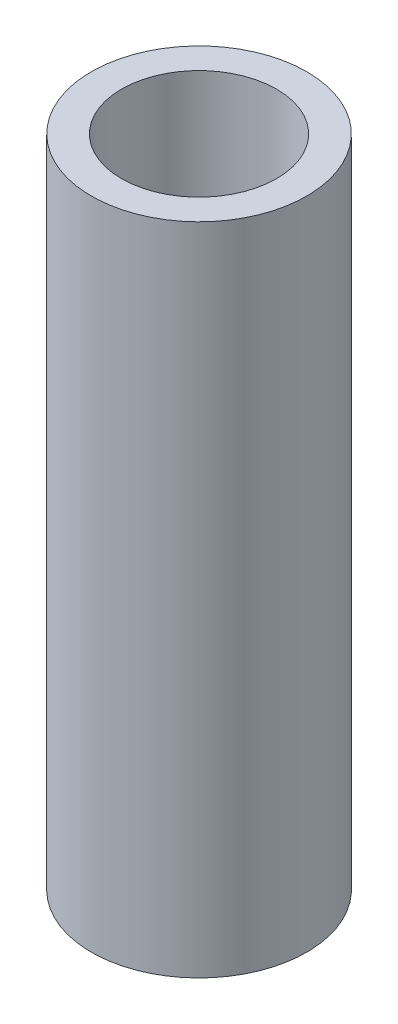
from build123d import *

# Parameters (mm, degrees)
SKETCH1_R           = 3.175
SKETCH1_R_2         = 2.286
BOSS_EXTRUDE1_DEPTH = 19.304


with BuildPart() as part:
    # Sketch1 → Boss-Extrude1 (new body)
    with BuildSketch(Plane(origin=(0, 0, 0), x_dir=(1, 0, 0), z_dir=(0, 1, 0))):
        with Locations(Location((0, 0, 0), (0, 0, 90))):
            Circle(SKETCH1_R)
        with Locations(Location((0, 0, 0), (0, 0, 90))):
            Circle(SKETCH1_R_2, mode=Mode.SUBTRACT)
    extrude(amount=BOSS_EXTRUDE1_DEPTH)


solid = part.part
